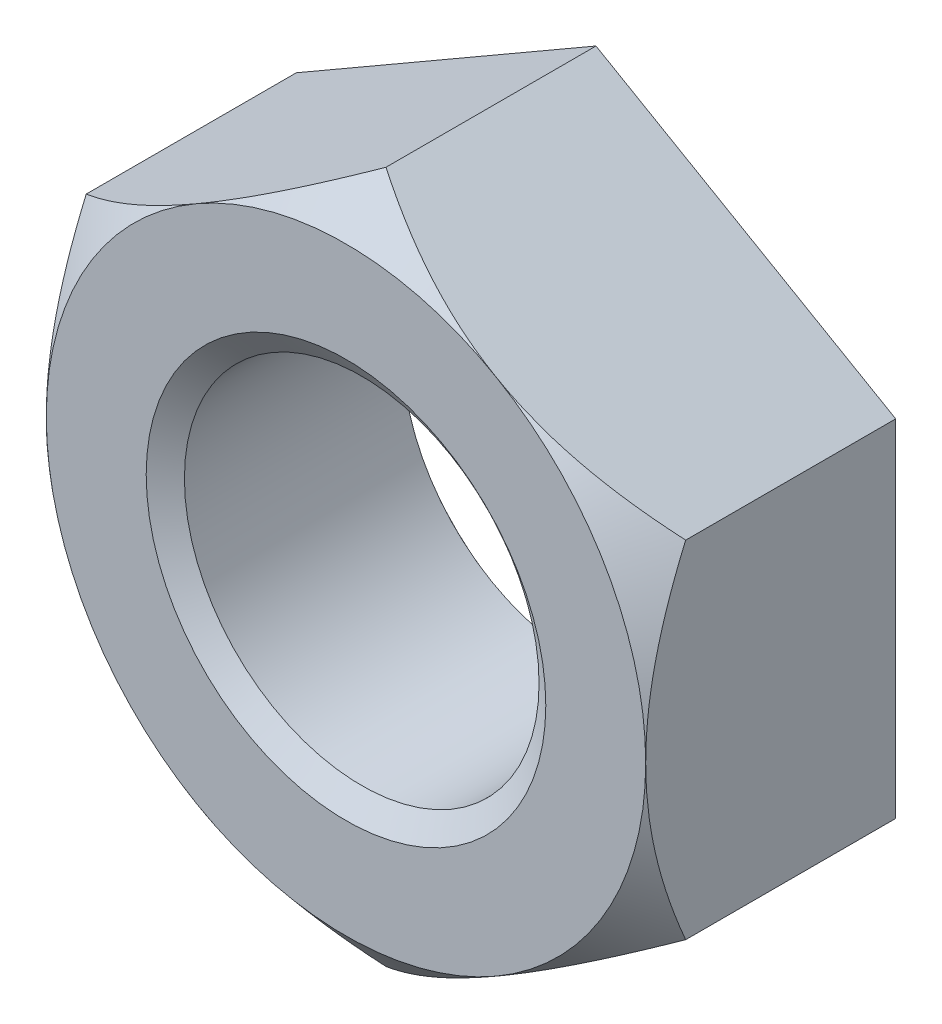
from build123d import *

# Parameters (mm, degrees)
BASENUT_START = -19.8628
BASENUTSKE_R  = 14.08938
BASENUT_DEPTH = 19.8628


with BuildPart() as part:
    # BaseNutSke → BaseNut (new body)
    with BuildSketch(Plane.XY.offset(BASENUT_START)):
        Polygon((23.8125, 13.748153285), (23.8125, -13.748153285), (0, -27.49630657), (-23.8125, -13.748153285), (-23.8125, 13.748153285), (0, 27.49630657), align=None)
        Circle(BASENUTSKE_R, mode=Mode.SUBTRACT)
    extrude(amount=BASENUT_DEPTH)

    # Sketch2 → Single-Chamfer (revolve, cut)
    with BuildSketch(Plane(origin=(0, 0, 0), x_dir=(0, 0, -1), z_dir=(1, 0, 0))):
        Polygon((0, 23.8125), (-12.7, 23.8125), (-12.7, 40.19630657), (3.175, 40.19630657), (3.175, 27.49630657), align=None)
    revolve(axis=Axis((0, 0, 0), (0, 0, -1)), mode=Mode.SUBTRACT)

    # EndChamferSketch → EndChamfer (revolve, cut)
    with BuildSketch(Plane(origin=(0, 0, 0), x_dir=(0, 0, -1), z_dir=(1, 0, 0)), mode=Mode.PRIVATE) as endchamfer_sk:
        Polygon((19.8374, 15.875), (18.462064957, 13.910818), (19.8882, 13.910818), (19.8882, 15.875), align=None)
        Polygon((-0.0508, 15.875), (0, 15.875), (1.375335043, 13.910818), (-0.0508, 13.910818), align=None)
    revolve(endchamfer_sk.sketch.rotate(Axis((0, 0, -25.037505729), (0, 0, -1)), 90), axis=Axis((0, 0, -25.037505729), (0, 0, -1)), mode=Mode.SUBTRACT)


solid = part.part
